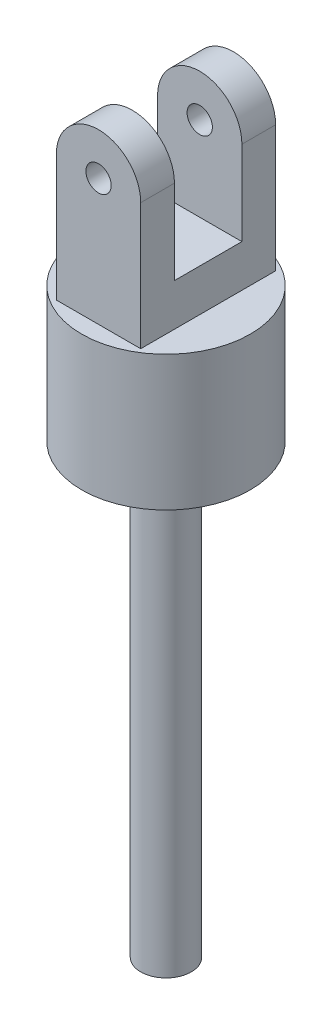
ISO-10303-21;
HEADER;
FILE_DESCRIPTION(('STEP AP214'),'2;1');
FILE_NAME('part.step','',(''),(''),'','','');
FILE_SCHEMA(('AUTOMOTIVE_DESIGN { 1 0 10303 214 1 1 1 1 }'));
ENDSEC;
DATA;
#1=APPLICATION_CONTEXT('core data for automotive mechanical design processes');
#2=APPLICATION_PROTOCOL_DEFINITION('international standard','automotive_design',2000,#1);
#3=PRODUCT_CONTEXT('',#1,'mechanical');
#4=PRODUCT('Part','Part','',(#3));
#5=PRODUCT_RELATED_PRODUCT_CATEGORY('part','',(#4));
#6=PRODUCT_DEFINITION_FORMATION('','',#4);
#7=PRODUCT_DEFINITION_CONTEXT('part definition',#1,'design');
#8=PRODUCT_DEFINITION('design','',#6,#7);
#9=PRODUCT_DEFINITION_SHAPE('','',#8);
#10=(LENGTH_UNIT() NAMED_UNIT(*) SI_UNIT(.MILLI.,.METRE.));
#11=(NAMED_UNIT(*) PLANE_ANGLE_UNIT() SI_UNIT($,.RADIAN.));
#12=(NAMED_UNIT(*) SI_UNIT($,.STERADIAN.) SOLID_ANGLE_UNIT());
#13=UNCERTAINTY_MEASURE_WITH_UNIT(LENGTH_MEASURE(1.E-05),#10,'distance_accuracy_value','');
#14=(GEOMETRIC_REPRESENTATION_CONTEXT(3) GLOBAL_UNCERTAINTY_ASSIGNED_CONTEXT((#13)) GLOBAL_UNIT_ASSIGNED_CONTEXT((#10,
#11,#12)) REPRESENTATION_CONTEXT('',''));
#15=CARTESIAN_POINT('',(0.,0.,0.));
#16=DIRECTION('',(0.,0.,1.));
#17=DIRECTION('',(1.,0.,0.));
#18=AXIS2_PLACEMENT_3D('',#15,#16,#17);
#19=CARTESIAN_POINT('',(0.,-9.,0.));
#20=DIRECTION('',(0.,-1.,0.));
#21=DIRECTION('',(0.,0.,-1.));
#22=AXIS2_PLACEMENT_3D('',#19,#20,#21);
#23=PLANE('',#22);
#24=CARTESIAN_POINT('',(-10.6521739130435,-9.,1.73913043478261));
#25=DIRECTION('',(0.,-1.,0.));
#26=DIRECTION('',(0.,0.,-1.));
#27=AXIS2_PLACEMENT_3D('',#24,#25,#26);
#28=CIRCLE('',#27,8.);
#29=CARTESIAN_POINT('',(-10.6521739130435,-9.,-6.26086956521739));
#30=VERTEX_POINT('',#29);
#31=EDGE_CURVE('E286',#30,#30,#28,.F.);
#32=ORIENTED_EDGE('',*,*,#31,.F.);
#33=EDGE_LOOP('',(#32));
#34=FACE_BOUND('',#33,.T.);
#35=CARTESIAN_POINT('',(-10.6521739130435,-9.,1.73913043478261));
#36=DIRECTION('',(0.,-1.,0.));
#37=DIRECTION('',(0.,0.,-1.));
#38=AXIS2_PLACEMENT_3D('',#35,#36,#37);
#39=CIRCLE('',#38,3.);
#40=CARTESIAN_POINT('',(-10.6521739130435,-9.,-1.26086956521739));
#41=VERTEX_POINT('',#40);
#42=EDGE_CURVE('E158',#41,#41,#39,.F.);
#43=ORIENTED_EDGE('',*,*,#42,.T.);
#44=EDGE_LOOP('',(#43));
#45=FACE_BOUND('',#44,.T.);
#46=ADVANCED_FACE('F79',(#34,#45),#23,.T.);
#47=CARTESIAN_POINT('',(0.,-74.,0.));
#48=DIRECTION('',(0.,-1.,0.));
#49=DIRECTION('',(0.,0.,-1.));
#50=AXIS2_PLACEMENT_3D('',#47,#48,#49);
#51=PLANE('',#50);
#52=CARTESIAN_POINT('',(-10.6521739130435,-74.,1.73913043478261));
#53=DIRECTION('',(0.,-1.,0.));
#54=DIRECTION('',(0.,0.,-1.));
#55=AXIS2_PLACEMENT_3D('',#52,#53,#54);
#56=CIRCLE('',#55,3.);
#57=CARTESIAN_POINT('',(-10.6521739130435,-74.,-1.26086956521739));
#58=VERTEX_POINT('',#57);
#59=EDGE_CURVE('E179',#58,#58,#56,.T.);
#60=ORIENTED_EDGE('',*,*,#59,.T.);
#61=EDGE_LOOP('',(#60));
#62=FACE_BOUND('',#61,.T.);
#63=ADVANCED_FACE('F261',(#62),#51,.T.);
#64=CARTESIAN_POINT('',(-10.6521739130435,-74.,1.73913043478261));
#65=DIRECTION('',(0.,1.,0.));
#66=DIRECTION('',(0.,0.,1.));
#67=AXIS2_PLACEMENT_3D('',#64,#65,#66);
#68=CYLINDRICAL_SURFACE('',#67,3.);
#69=ORIENTED_EDGE('',*,*,#42,.F.);
#70=EDGE_LOOP('',(#69));
#71=FACE_BOUND('',#70,.T.);
#72=ORIENTED_EDGE('',*,*,#59,.F.);
#73=EDGE_LOOP('',(#72));
#74=FACE_BOUND('',#73,.T.);
#75=ADVANCED_FACE('F267',(#71,#74),#68,.T.);
#76=CARTESIAN_POINT('',(-10.6521739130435,-21.,1.73913043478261));
#77=DIRECTION('',(0.,1.,0.));
#78=DIRECTION('',(0.,0.,1.));
#79=AXIS2_PLACEMENT_3D('',#76,#77,#78);
#80=CYLINDRICAL_SURFACE('',#79,8.);
#81=ORIENTED_EDGE('',*,*,#31,.T.);
#82=EDGE_LOOP('',(#81));
#83=FACE_BOUND('',#82,.T.);
#84=CARTESIAN_POINT('',(-10.6521739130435,-21.,1.73913043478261));
#85=DIRECTION('',(0.,-1.,0.));
#86=DIRECTION('',(0.,0.,-1.));
#87=AXIS2_PLACEMENT_3D('',#84,#85,#86);
#88=CIRCLE('',#87,8.);
#89=CARTESIAN_POINT('',(-10.6521739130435,-21.,-6.26086956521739));
#90=VERTEX_POINT('',#89);
#91=EDGE_CURVE('E294',#90,#90,#88,.T.);
#92=ORIENTED_EDGE('',*,*,#91,.T.);
#93=EDGE_LOOP('',(#92));
#94=FACE_BOUND('',#93,.T.);
#95=ADVANCED_FACE('F273',(#83,#94),#80,.F.);
#96=CARTESIAN_POINT('',(-10.6521739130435,-21.,1.73913043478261));
#97=DIRECTION('',(0.,1.,0.));
#98=DIRECTION('',(0.,0.,1.));
#99=AXIS2_PLACEMENT_3D('',#96,#97,#98);
#100=CYLINDRICAL_SURFACE('',#99,10.);
#101=CARTESIAN_POINT('',(-10.6521739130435,-21.,1.73913043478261));
#102=DIRECTION('',(0.,-1.,0.));
#103=DIRECTION('',(0.,0.,-1.));
#104=AXIS2_PLACEMENT_3D('',#101,#102,#103);
#105=CIRCLE('',#104,10.);
#106=CARTESIAN_POINT('',(-10.6521739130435,-21.,-8.26086956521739));
#107=VERTEX_POINT('',#106);
#108=EDGE_CURVE('E288',#107,#107,#105,.T.);
#109=ORIENTED_EDGE('',*,*,#108,.F.);
#110=EDGE_LOOP('',(#109));
#111=FACE_BOUND('',#110,.T.);
#112=CARTESIAN_POINT('',(-10.6521739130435,-5.,1.73913043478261));
#113=DIRECTION('',(0.,-1.,0.));
#114=DIRECTION('',(0.,0.,-1.));
#115=AXIS2_PLACEMENT_3D('',#112,#113,#114);
#116=CIRCLE('',#115,10.);
#117=CARTESIAN_POINT('',(-10.6521739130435,-5.,-8.26086956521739));
#118=VERTEX_POINT('',#117);
#119=EDGE_CURVE('E291',#118,#118,#116,.T.);
#120=ORIENTED_EDGE('',*,*,#119,.T.);
#121=EDGE_LOOP('',(#120));
#122=FACE_BOUND('',#121,.T.);
#123=ADVANCED_FACE('F280',(#111,#122),#100,.T.);
#124=CARTESIAN_POINT('',(0.,-21.,0.));
#125=DIRECTION('',(0.,-1.,0.));
#126=DIRECTION('',(0.,0.,-1.));
#127=AXIS2_PLACEMENT_3D('',#124,#125,#126);
#128=PLANE('',#127);
#129=ORIENTED_EDGE('',*,*,#91,.F.);
#130=EDGE_LOOP('',(#129));
#131=FACE_BOUND('',#130,.T.);
#132=ORIENTED_EDGE('',*,*,#108,.T.);
#133=EDGE_LOOP('',(#132));
#134=FACE_BOUND('',#133,.T.);
#135=ADVANCED_FACE('F301',(#131,#134),#128,.T.);
#136=CARTESIAN_POINT('',(-10.6521739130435,10.,-13.3319373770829));
#137=DIRECTION('',(0.,0.,1.));
#138=DIRECTION('',(1.,0.,0.));
#139=AXIS2_PLACEMENT_3D('',#136,#137,#138);
#140=CYLINDRICAL_SURFACE('',#139,1.5);
#141=CARTESIAN_POINT('',(-10.6521739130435,10.,-6.26086956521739));
#142=DIRECTION('',(0.,0.,-1.));
#143=DIRECTION('',(-1.,0.,0.));
#144=AXIS2_PLACEMENT_3D('',#141,#142,#143);
#145=CIRCLE('',#144,1.5);
#146=CARTESIAN_POINT('',(-12.1521739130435,10.,-6.26086956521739));
#147=VERTEX_POINT('',#146);
#148=EDGE_CURVE('E194',#147,#147,#145,.F.);
#149=ORIENTED_EDGE('',*,*,#148,.F.);
#150=EDGE_LOOP('',(#149));
#151=FACE_BOUND('',#150,.T.);
#152=CARTESIAN_POINT('',(-10.6521739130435,10.,-2.26086956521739));
#153=DIRECTION('',(0.,0.,-1.));
#154=DIRECTION('',(-1.,0.,0.));
#155=AXIS2_PLACEMENT_3D('',#152,#153,#154);
#156=CIRCLE('',#155,1.5);
#157=CARTESIAN_POINT('',(-12.1521739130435,10.,-2.26086956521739));
#158=VERTEX_POINT('',#157);
#159=EDGE_CURVE('E202',#158,#158,#156,.T.);
#160=ORIENTED_EDGE('',*,*,#159,.F.);
#161=EDGE_LOOP('',(#160));
#162=FACE_BOUND('',#161,.T.);
#163=ADVANCED_FACE('F304',(#151,#162),#140,.F.);
#164=CARTESIAN_POINT('',(-10.6521739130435,10.,5.73913043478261));
#165=DIRECTION('',(0.,0.,-1.));
#166=DIRECTION('',(-1.,0.,0.));
#167=AXIS2_PLACEMENT_3D('',#164,#165,#166);
#168=CIRCLE('',#167,1.5);
#169=CARTESIAN_POINT('',(-12.1521739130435,10.,5.73913043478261));
#170=VERTEX_POINT('',#169);
#171=EDGE_CURVE('E201',#170,#170,#168,.T.);
#172=ORIENTED_EDGE('',*,*,#171,.T.);
#173=EDGE_LOOP('',(#172));
#174=FACE_BOUND('',#173,.T.);
#175=CARTESIAN_POINT('',(-10.6521739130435,10.,9.73913043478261));
#176=DIRECTION('',(0.,0.,1.));
#177=DIRECTION('',(1.,0.,0.));
#178=AXIS2_PLACEMENT_3D('',#175,#176,#177);
#179=CIRCLE('',#178,1.5);
#180=CARTESIAN_POINT('',(-9.15217391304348,10.,9.73913043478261));
#181=VERTEX_POINT('',#180);
#182=EDGE_CURVE('E187',#181,#181,#179,.T.);
#183=ORIENTED_EDGE('',*,*,#182,.T.);
#184=EDGE_LOOP('',(#183));
#185=FACE_BOUND('',#184,.T.);
#186=ADVANCED_FACE('F226',(#174,#185),#140,.F.);
#187=CARTESIAN_POINT('',(0.,15.,-2.26086956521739));
#188=DIRECTION('',(0.,0.,-1.));
#189=DIRECTION('',(-1.,0.,0.));
#190=AXIS2_PLACEMENT_3D('',#187,#188,#189);
#191=PLANE('',#190);
#192=ORIENTED_EDGE('',*,*,#159,.T.);
#193=EDGE_LOOP('',(#192));
#194=FACE_BOUND('',#193,.T.);
#195=DIRECTION('',(0.,-1.,0.));
#196=VECTOR('',#195,1.);
#197=CARTESIAN_POINT('',(-5.65217391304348,15.,-2.26086956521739));
#198=LINE('',#197,#196);
#199=CARTESIAN_POINT('',(-5.65217391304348,10.,-2.26086956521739));
#200=VERTEX_POINT('',#199);
#201=CARTESIAN_POINT('',(-5.65217391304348,0.,-2.26086956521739));
#202=VERTEX_POINT('',#201);
#203=EDGE_CURVE('E217',#200,#202,#198,.T.);
#204=ORIENTED_EDGE('',*,*,#203,.F.);
#205=CARTESIAN_POINT('',(-10.6521739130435,10.,-2.26086956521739));
#206=DIRECTION('',(0.,0.,-1.));
#207=DIRECTION('',(-1.,0.,0.));
#208=AXIS2_PLACEMENT_3D('',#205,#206,#207);
#209=CIRCLE('',#208,5.);
#210=CARTESIAN_POINT('',(-15.6521739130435,10.,-2.26086956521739));
#211=VERTEX_POINT('',#210);
#212=EDGE_CURVE('E199',#211,#200,#209,.T.);
#213=ORIENTED_EDGE('',*,*,#212,.F.);
#214=DIRECTION('',(0.,-1.,0.));
#215=VECTOR('',#214,1.);
#216=CARTESIAN_POINT('',(-15.6521739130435,15.,-2.26086956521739));
#217=LINE('',#216,#215);
#218=CARTESIAN_POINT('',(-15.6521739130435,0.,-2.26086956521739));
#219=VERTEX_POINT('',#218);
#220=EDGE_CURVE('E219',#211,#219,#217,.T.);
#221=ORIENTED_EDGE('',*,*,#220,.T.);
#222=DIRECTION('',(1.,0.,0.));
#223=VECTOR('',#222,1.);
#224=CARTESIAN_POINT('',(0.,0.,-2.26086956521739));
#225=LINE('',#224,#223);
#226=EDGE_CURVE('E213',#219,#202,#225,.T.);
#227=ORIENTED_EDGE('',*,*,#226,.T.);
#228=EDGE_LOOP('',(#204,#213,#221,#227));
#229=FACE_BOUND('',#228,.T.);
#230=ADVANCED_FACE('F243',(#194,#229),#191,.F.);
#231=CARTESIAN_POINT('',(0.,0.,0.));
#232=DIRECTION('',(0.,1.,0.));
#233=DIRECTION('',(0.,0.,1.));
#234=AXIS2_PLACEMENT_3D('',#231,#232,#233);
#235=PLANE('',#234);
#236=DIRECTION('',(1.,0.,0.));
#237=VECTOR('',#236,1.);
#238=CARTESIAN_POINT('',(0.,0.,5.73913043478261));
#239=LINE('',#238,#237);
#240=CARTESIAN_POINT('',(-15.6521739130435,0.,5.73913043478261));
#241=VERTEX_POINT('',#240);
#242=CARTESIAN_POINT('',(-5.65217391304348,0.,5.73913043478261));
#243=VERTEX_POINT('',#242);
#244=EDGE_CURVE('E205',#241,#243,#239,.T.);
#245=ORIENTED_EDGE('',*,*,#244,.T.);
#246=DIRECTION('',(0.,0.,1.));
#247=VECTOR('',#246,1.);
#248=CARTESIAN_POINT('',(-5.65217391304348,0.,0.));
#249=LINE('',#248,#247);
#250=EDGE_CURVE('E166',#202,#243,#249,.T.);
#251=ORIENTED_EDGE('',*,*,#250,.F.);
#252=ORIENTED_EDGE('',*,*,#226,.F.);
#253=DIRECTION('',(0.,0.,1.));
#254=VECTOR('',#253,1.);
#255=CARTESIAN_POINT('',(-15.6521739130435,0.,0.));
#256=LINE('',#255,#254);
#257=EDGE_CURVE('E209',#219,#241,#256,.T.);
#258=ORIENTED_EDGE('',*,*,#257,.T.);
#259=EDGE_LOOP('',(#245,#251,#252,#258));
#260=FACE_BOUND('',#259,.T.);
#261=ADVANCED_FACE('F232',(#260),#235,.T.);
#262=CARTESIAN_POINT('',(0.,15.,5.73913043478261));
#263=DIRECTION('',(0.,0.,-1.));
#264=DIRECTION('',(-1.,0.,0.));
#265=AXIS2_PLACEMENT_3D('',#262,#263,#264);
#266=PLANE('',#265);
#267=ORIENTED_EDGE('',*,*,#171,.F.);
#268=EDGE_LOOP('',(#267));
#269=FACE_BOUND('',#268,.T.);
#270=CARTESIAN_POINT('',(-10.6521739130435,10.,5.73913043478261));
#271=DIRECTION('',(0.,0.,-1.));
#272=DIRECTION('',(-1.,0.,0.));
#273=AXIS2_PLACEMENT_3D('',#270,#271,#272);
#274=CIRCLE('',#273,5.);
#275=CARTESIAN_POINT('',(-15.6521739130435,10.,5.73913043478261));
#276=VERTEX_POINT('',#275);
#277=CARTESIAN_POINT('',(-5.65217391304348,10.,5.73913043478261));
#278=VERTEX_POINT('',#277);
#279=EDGE_CURVE('E197',#276,#278,#274,.T.);
#280=ORIENTED_EDGE('',*,*,#279,.T.);
#281=DIRECTION('',(0.,-1.,0.));
#282=VECTOR('',#281,1.);
#283=CARTESIAN_POINT('',(-5.65217391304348,15.,5.73913043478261));
#284=LINE('',#283,#282);
#285=EDGE_CURVE('E94',#278,#243,#284,.T.);
#286=ORIENTED_EDGE('',*,*,#285,.T.);
#287=ORIENTED_EDGE('',*,*,#244,.F.);
#288=DIRECTION('',(0.,-1.,0.));
#289=VECTOR('',#288,1.);
#290=CARTESIAN_POINT('',(-15.6521739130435,15.,5.73913043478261));
#291=LINE('',#290,#289);
#292=EDGE_CURVE('E102',#276,#241,#291,.T.);
#293=ORIENTED_EDGE('',*,*,#292,.F.);
#294=EDGE_LOOP('',(#280,#286,#287,#293));
#295=FACE_BOUND('',#294,.T.);
#296=ADVANCED_FACE('F229',(#269,#295),#266,.T.);
#297=CARTESIAN_POINT('',(-10.6521739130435,10.,-13.3319373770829));
#298=DIRECTION('',(0.,0.,1.));
#299=DIRECTION('',(1.,0.,0.));
#300=AXIS2_PLACEMENT_3D('',#297,#298,#299);
#301=CYLINDRICAL_SURFACE('',#300,5.);
#302=DIRECTION('',(0.,0.,1.));
#303=VECTOR('',#302,1.);
#304=CARTESIAN_POINT('',(-15.6521739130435,10.,-13.3319373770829));
#305=LINE('',#304,#303);
#306=CARTESIAN_POINT('',(-15.6521739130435,10.,9.73913043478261));
#307=VERTEX_POINT('',#306);
#308=EDGE_CURVE('E190',#276,#307,#305,.T.);
#309=ORIENTED_EDGE('',*,*,#308,.T.);
#310=CARTESIAN_POINT('',(-10.6521739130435,10.,9.73913043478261));
#311=DIRECTION('',(0.,0.,1.));
#312=DIRECTION('',(1.,0.,0.));
#313=AXIS2_PLACEMENT_3D('',#310,#311,#312);
#314=CIRCLE('',#313,5.);
#315=CARTESIAN_POINT('',(-5.65217391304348,10.,9.73913043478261));
#316=VERTEX_POINT('',#315);
#317=EDGE_CURVE('E164',#316,#307,#314,.T.);
#318=ORIENTED_EDGE('',*,*,#317,.F.);
#319=DIRECTION('',(0.,0.,1.));
#320=VECTOR('',#319,1.);
#321=CARTESIAN_POINT('',(-5.65217391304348,10.,-13.3319373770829));
#322=LINE('',#321,#320);
#323=EDGE_CURVE('E12',#278,#316,#322,.T.);
#324=ORIENTED_EDGE('',*,*,#323,.F.);
#325=ORIENTED_EDGE('',*,*,#279,.F.);
#326=EDGE_LOOP('',(#309,#318,#324,#325));
#327=FACE_BOUND('',#326,.T.);
#328=ADVANCED_FACE('F231',(#327),#301,.T.);
#329=ORIENTED_EDGE('',*,*,#212,.T.);
#330=DIRECTION('',(0.,0.,1.));
#331=VECTOR('',#330,1.);
#332=CARTESIAN_POINT('',(-5.65217391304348,10.,-13.3319373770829));
#333=LINE('',#332,#331);
#334=CARTESIAN_POINT('',(-5.65217391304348,10.,-6.26086956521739));
#335=VERTEX_POINT('',#334);
#336=EDGE_CURVE('E182',#335,#200,#333,.T.);
#337=ORIENTED_EDGE('',*,*,#336,.F.);
#338=CARTESIAN_POINT('',(-10.6521739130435,10.,-6.26086956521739));
#339=DIRECTION('',(0.,0.,-1.));
#340=DIRECTION('',(-1.,0.,0.));
#341=AXIS2_PLACEMENT_3D('',#338,#339,#340);
#342=CIRCLE('',#341,5.);
#343=CARTESIAN_POINT('',(-15.6521739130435,10.,-6.26086956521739));
#344=VERTEX_POINT('',#343);
#345=EDGE_CURVE('E185',#335,#344,#342,.F.);
#346=ORIENTED_EDGE('',*,*,#345,.T.);
#347=EDGE_CURVE('E188',#344,#211,#305,.T.);
#348=ORIENTED_EDGE('',*,*,#347,.T.);
#349=EDGE_LOOP('',(#329,#337,#346,#348));
#350=FACE_BOUND('',#349,.T.);
#351=ADVANCED_FACE('F250',(#350),#301,.T.);
#352=CARTESIAN_POINT('',(0.,-5.,0.));
#353=DIRECTION('',(0.,-1.,0.));
#354=DIRECTION('',(0.,0.,-1.));
#355=AXIS2_PLACEMENT_3D('',#352,#353,#354);
#356=PLANE('',#355);
#357=DIRECTION('',(0.,0.,-1.));
#358=VECTOR('',#357,1.);
#359=CARTESIAN_POINT('',(-15.6521739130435,-5.,9.73913043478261));
#360=LINE('',#359,#358);
#361=CARTESIAN_POINT('',(-15.6521739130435,-5.,9.73913043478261));
#362=VERTEX_POINT('',#361);
#363=CARTESIAN_POINT('',(-15.6521739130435,-5.,-6.26086956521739));
#364=VERTEX_POINT('',#363);
#365=EDGE_CURVE('E151',#362,#364,#360,.T.);
#366=ORIENTED_EDGE('',*,*,#365,.T.);
#367=DIRECTION('',(1.,0.,0.));
#368=VECTOR('',#367,1.);
#369=CARTESIAN_POINT('',(-15.6521739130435,-5.,-6.26086956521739));
#370=LINE('',#369,#368);
#371=CARTESIAN_POINT('',(-5.65217391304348,-5.,-6.26086956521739));
#372=VERTEX_POINT('',#371);
#373=EDGE_CURVE('E173',#364,#372,#370,.T.);
#374=ORIENTED_EDGE('',*,*,#373,.T.);
#375=DIRECTION('',(0.,0.,1.));
#376=VECTOR('',#375,1.);
#377=CARTESIAN_POINT('',(-5.65217391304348,-5.,-6.26086956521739));
#378=LINE('',#377,#376);
#379=CARTESIAN_POINT('',(-5.65217391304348,-5.,9.73913043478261));
#380=VERTEX_POINT('',#379);
#381=EDGE_CURVE('E154',#372,#380,#378,.T.);
#382=ORIENTED_EDGE('',*,*,#381,.T.);
#383=DIRECTION('',(-1.,0.,0.));
#384=VECTOR('',#383,1.);
#385=CARTESIAN_POINT('',(-5.65217391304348,-5.,9.73913043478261));
#386=LINE('',#385,#384);
#387=EDGE_CURVE('E146',#380,#362,#386,.T.);
#388=ORIENTED_EDGE('',*,*,#387,.T.);
#389=EDGE_LOOP('',(#366,#374,#382,#388));
#390=FACE_BOUND('',#389,.T.);
#391=ORIENTED_EDGE('',*,*,#119,.F.);
#392=EDGE_LOOP('',(#391));
#393=FACE_BOUND('',#392,.T.);
#394=ADVANCED_FACE('F148',(#390,#393),#356,.F.);
#395=CARTESIAN_POINT('',(-15.6521739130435,15.,0.));
#396=DIRECTION('',(1.,0.,0.));
#397=DIRECTION('',(0.,0.,-1.));
#398=AXIS2_PLACEMENT_3D('',#395,#396,#397);
#399=PLANE('',#398);
#400=ORIENTED_EDGE('',*,*,#347,.F.);
#401=DIRECTION('',(0.,-1.,0.));
#402=VECTOR('',#401,1.);
#403=CARTESIAN_POINT('',(-15.6521739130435,15.,-6.26086956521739));
#404=LINE('',#403,#402);
#405=EDGE_CURVE('E171',#344,#364,#404,.T.);
#406=ORIENTED_EDGE('',*,*,#405,.T.);
#407=ORIENTED_EDGE('',*,*,#365,.F.);
#408=DIRECTION('',(0.,1.,0.));
#409=VECTOR('',#408,1.);
#410=CARTESIAN_POINT('',(-15.6521739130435,-4.,9.73913043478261));
#411=LINE('',#410,#409);
#412=EDGE_CURVE('E162',#362,#307,#411,.T.);
#413=ORIENTED_EDGE('',*,*,#412,.T.);
#414=ORIENTED_EDGE('',*,*,#308,.F.);
#415=ORIENTED_EDGE('',*,*,#292,.T.);
#416=ORIENTED_EDGE('',*,*,#257,.F.);
#417=ORIENTED_EDGE('',*,*,#220,.F.);
#418=EDGE_LOOP('',(#400,#406,#407,#413,#414,#415,#416,#417));
#419=FACE_BOUND('',#418,.T.);
#420=ADVANCED_FACE('F169',(#419),#399,.F.);
#421=CARTESIAN_POINT('',(-5.65217391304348,15.,0.));
#422=DIRECTION('',(1.,0.,0.));
#423=DIRECTION('',(0.,0.,-1.));
#424=AXIS2_PLACEMENT_3D('',#421,#422,#423);
#425=PLANE('',#424);
#426=DIRECTION('',(0.,-1.,0.));
#427=VECTOR('',#426,1.);
#428=CARTESIAN_POINT('',(-5.65217391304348,15.,-6.26086956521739));
#429=LINE('',#428,#427);
#430=EDGE_CURVE('E87',#335,#372,#429,.T.);
#431=ORIENTED_EDGE('',*,*,#430,.F.);
#432=ORIENTED_EDGE('',*,*,#336,.T.);
#433=ORIENTED_EDGE('',*,*,#203,.T.);
#434=ORIENTED_EDGE('',*,*,#250,.T.);
#435=ORIENTED_EDGE('',*,*,#285,.F.);
#436=ORIENTED_EDGE('',*,*,#323,.T.);
#437=DIRECTION('',(0.,1.,0.));
#438=VECTOR('',#437,1.);
#439=CARTESIAN_POINT('',(-5.65217391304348,-4.,9.73913043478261));
#440=LINE('',#439,#438);
#441=EDGE_CURVE('E165',#380,#316,#440,.T.);
#442=ORIENTED_EDGE('',*,*,#441,.F.);
#443=ORIENTED_EDGE('',*,*,#381,.F.);
#444=EDGE_LOOP('',(#431,#432,#433,#434,#435,#436,#442,#443));
#445=FACE_BOUND('',#444,.T.);
#446=ADVANCED_FACE('F81',(#445),#425,.T.);
#447=CARTESIAN_POINT('',(0.,-4.,9.73913043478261));
#448=DIRECTION('',(0.,0.,1.));
#449=DIRECTION('',(1.,0.,0.));
#450=AXIS2_PLACEMENT_3D('',#447,#448,#449);
#451=PLANE('',#450);
#452=ORIENTED_EDGE('',*,*,#182,.F.);
#453=EDGE_LOOP('',(#452));
#454=FACE_BOUND('',#453,.T.);
#455=ORIENTED_EDGE('',*,*,#441,.T.);
#456=ORIENTED_EDGE('',*,*,#317,.T.);
#457=ORIENTED_EDGE('',*,*,#412,.F.);
#458=ORIENTED_EDGE('',*,*,#387,.F.);
#459=EDGE_LOOP('',(#455,#456,#457,#458));
#460=FACE_BOUND('',#459,.T.);
#461=ADVANCED_FACE('F163',(#454,#460),#451,.T.);
#462=CARTESIAN_POINT('',(0.,15.,-6.26086956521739));
#463=DIRECTION('',(0.,0.,-1.));
#464=DIRECTION('',(-1.,0.,0.));
#465=AXIS2_PLACEMENT_3D('',#462,#463,#464);
#466=PLANE('',#465);
#467=ORIENTED_EDGE('',*,*,#148,.T.);
#468=EDGE_LOOP('',(#467));
#469=FACE_BOUND('',#468,.T.);
#470=ORIENTED_EDGE('',*,*,#345,.F.);
#471=ORIENTED_EDGE('',*,*,#430,.T.);
#472=ORIENTED_EDGE('',*,*,#373,.F.);
#473=ORIENTED_EDGE('',*,*,#405,.F.);
#474=EDGE_LOOP('',(#470,#471,#472,#473));
#475=FACE_BOUND('',#474,.T.);
#476=ADVANCED_FACE('F248',(#469,#475),#466,.T.);
#477=CLOSED_SHELL('',(#46,#63,#75,#95,#123,#135,#163,#186,#230,#261,#296,#328,#351,#394,#420,
#446,#461,#476));
#478=MANIFOLD_SOLID_BREP('B2',#477);
#479=ADVANCED_BREP_SHAPE_REPRESENTATION('',(#18,#478),#14);
#480=SHAPE_DEFINITION_REPRESENTATION(#9,#479);
ENDSEC;
END-ISO-10303-21;
